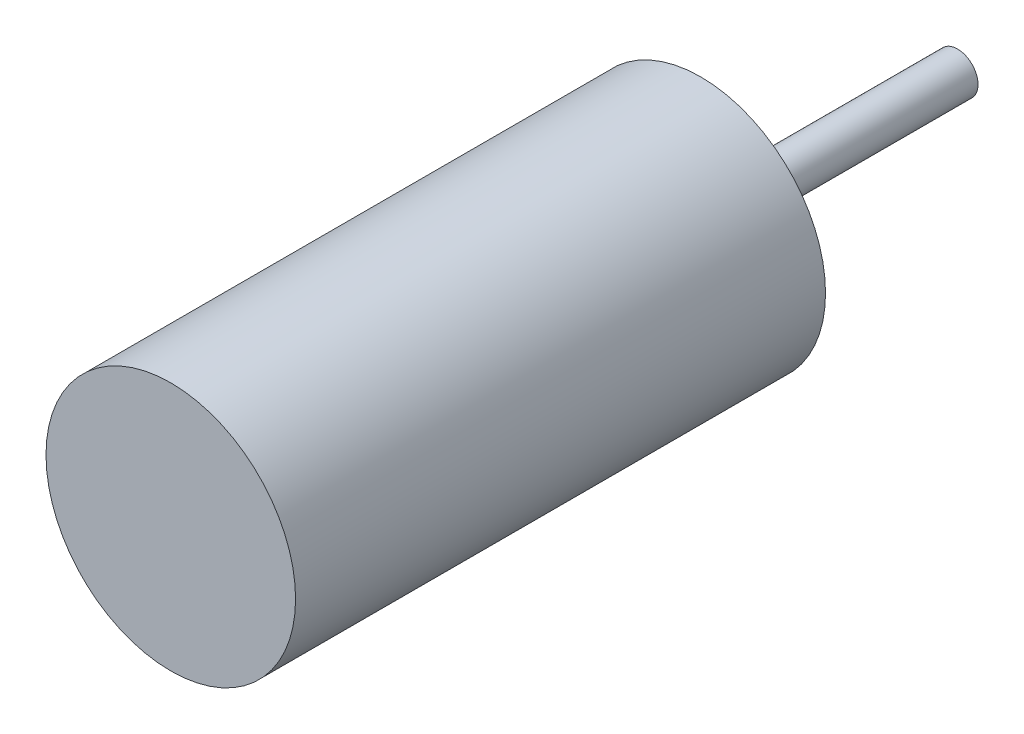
from build123d import *

# Parameters (mm, degrees)
SKETCH1_R           = 12.15
BOSS_EXTRUDE1_DEPTH = 51.6
SKETCH2_R           = 3.5
BOSS_EXTRUDE2_DEPTH = 2.4
SKETCH3_R           = 2
BOSS_EXTRUDE3_DEPTH = 22.6


with BuildPart() as part:
    # Sketch1 → Boss-Extrude1 (new body)
    with BuildSketch(Plane.XY):
        with Locations(Location((0, 0, 0), (0, 0, 180))):
            Circle(SKETCH1_R)
    extrude(amount=BOSS_EXTRUDE1_DEPTH)

    # Sketch2 → Boss-Extrude2 (add)
    with BuildSketch(Plane(origin=(0, 0, 0), x_dir=(-1, 0, 0), z_dir=(0, 0, -1))):
        Circle(SKETCH2_R)
    extrude(amount=BOSS_EXTRUDE2_DEPTH)

    # Sketch3 → Boss-Extrude3 (add)
    with BuildSketch(Plane(origin=(0, 0, -2.4), x_dir=(-1, 0, 0), z_dir=(0, 0, -1))):
        Circle(SKETCH3_R)
    extrude(amount=BOSS_EXTRUDE3_DEPTH)


solid = part.part
